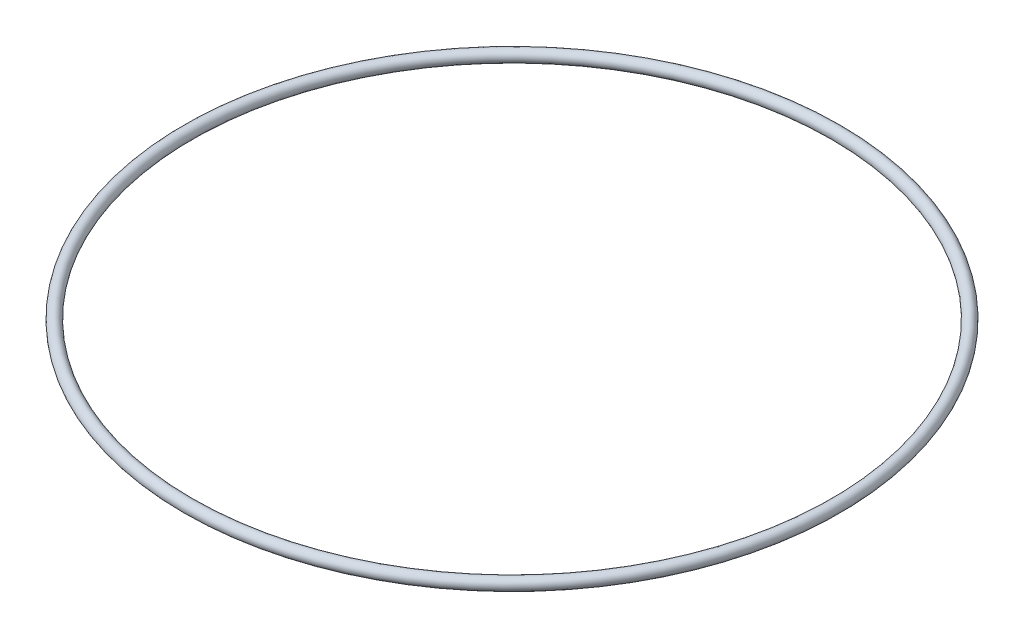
from build123d import *

# Parameters (mm, degrees)
ESQUISSE1_R = 1.25


with BuildPart() as part:
    # Esquisse1 → Base-R_volution (revolve)
    with BuildSketch(Plane.XY, mode=Mode.PRIVATE) as base_r_volution_sk:
        with Locations((68.75, 0)):
            Circle(ESQUISSE1_R)
    revolve(base_r_volution_sk.sketch.rotate(Axis((0, 1.25, 0), (0, -1, 0)), 90), axis=Axis((0, 1.25, 0), (0, -1, 0)))


solid = part.part
